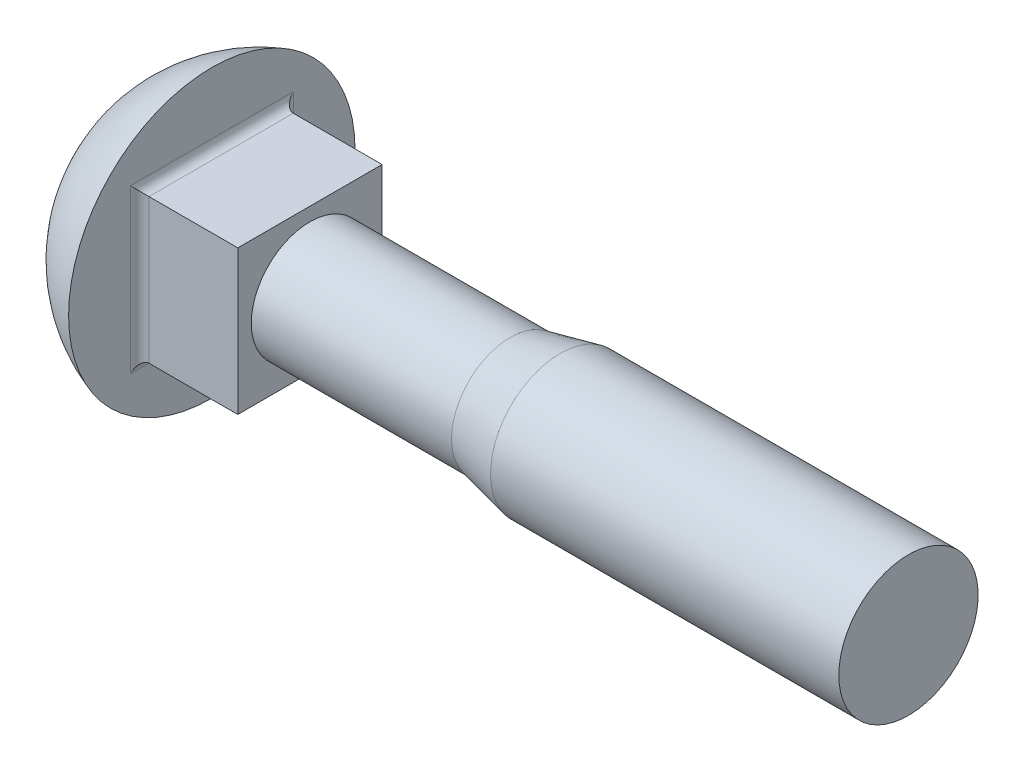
ISO-10303-21;
HEADER;
FILE_DESCRIPTION(('STEP AP214'),'2;1');
FILE_NAME('part.step','',(''),(''),'','','');
FILE_SCHEMA(('AUTOMOTIVE_DESIGN { 1 0 10303 214 1 1 1 1 }'));
ENDSEC;
DATA;
#1=APPLICATION_CONTEXT('core data for automotive mechanical design processes');
#2=APPLICATION_PROTOCOL_DEFINITION('international standard','automotive_design',2000,#1);
#3=PRODUCT_CONTEXT('',#1,'mechanical');
#4=PRODUCT('Part','Part','',(#3));
#5=PRODUCT_RELATED_PRODUCT_CATEGORY('part','',(#4));
#6=PRODUCT_DEFINITION_FORMATION('','',#4);
#7=PRODUCT_DEFINITION_CONTEXT('part definition',#1,'design');
#8=PRODUCT_DEFINITION('design','',#6,#7);
#9=PRODUCT_DEFINITION_SHAPE('','',#8);
#10=(LENGTH_UNIT() NAMED_UNIT(*) SI_UNIT(.MILLI.,.METRE.));
#11=(NAMED_UNIT(*) PLANE_ANGLE_UNIT() SI_UNIT($,.RADIAN.));
#12=(NAMED_UNIT(*) SI_UNIT($,.STERADIAN.) SOLID_ANGLE_UNIT());
#13=UNCERTAINTY_MEASURE_WITH_UNIT(LENGTH_MEASURE(1.E-05),#10,'distance_accuracy_value','');
#14=(GEOMETRIC_REPRESENTATION_CONTEXT(3) GLOBAL_UNCERTAINTY_ASSIGNED_CONTEXT((#13)) GLOBAL_UNIT_ASSIGNED_CONTEXT((#10,
#11,#12)) REPRESENTATION_CONTEXT('',''));
#15=CARTESIAN_POINT('',(0.,0.,0.));
#16=DIRECTION('',(0.,0.,1.));
#17=DIRECTION('',(1.,0.,0.));
#18=AXIS2_PLACEMENT_3D('',#15,#16,#17);
#19=CARTESIAN_POINT('',(17.35,-6.21499999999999,6.215));
#20=DIRECTION('',(-1.,0.,0.));
#21=DIRECTION('',(0.,0.,1.));
#22=AXIS2_PLACEMENT_3D('',#19,#20,#21);
#23=PLANE('',#22);
#24=DIRECTION('',(0.,0.,-1.));
#25=VECTOR('',#24,1.);
#26=CARTESIAN_POINT('',(17.35,-6.215,6.215));
#27=LINE('',#26,#25);
#28=CARTESIAN_POINT('',(17.35,-6.215,6.215));
#29=VERTEX_POINT('',#28);
#30=CARTESIAN_POINT('',(17.35,-6.215,-6.215));
#31=VERTEX_POINT('',#30);
#32=EDGE_CURVE('E109',#29,#31,#27,.T.);
#33=ORIENTED_EDGE('',*,*,#32,.T.);
#34=DIRECTION('',(0.,1.,0.));
#35=VECTOR('',#34,1.);
#36=CARTESIAN_POINT('',(17.35,-6.215,-6.215));
#37=LINE('',#36,#35);
#38=CARTESIAN_POINT('',(17.35,6.215,-6.215));
#39=VERTEX_POINT('',#38);
#40=EDGE_CURVE('E98',#31,#39,#37,.T.);
#41=ORIENTED_EDGE('',*,*,#40,.T.);
#42=DIRECTION('',(0.,0.,1.));
#43=VECTOR('',#42,1.);
#44=CARTESIAN_POINT('',(17.35,6.215,-6.215));
#45=LINE('',#44,#43);
#46=CARTESIAN_POINT('',(17.35,6.215,6.215));
#47=VERTEX_POINT('',#46);
#48=EDGE_CURVE('E108',#39,#47,#45,.T.);
#49=ORIENTED_EDGE('',*,*,#48,.T.);
#50=DIRECTION('',(0.,-1.,0.));
#51=VECTOR('',#50,1.);
#52=CARTESIAN_POINT('',(17.35,6.215,6.215));
#53=LINE('',#52,#51);
#54=EDGE_CURVE('E114',#47,#29,#53,.T.);
#55=ORIENTED_EDGE('',*,*,#54,.T.);
#56=EDGE_LOOP('',(#33,#41,#49,#55));
#57=FACE_BOUND('',#56,.T.);
#58=CARTESIAN_POINT('',(17.35,0.,0.));
#59=DIRECTION('',(-1.,0.,0.));
#60=DIRECTION('',(0.,0.,1.));
#61=AXIS2_PLACEMENT_3D('',#58,#59,#60);
#62=CIRCLE('',#61,5.053);
#63=CARTESIAN_POINT('',(17.35,0.,5.053));
#64=VERTEX_POINT('',#63);
#65=EDGE_CURVE('E154',#64,#64,#62,.T.);
#66=ORIENTED_EDGE('',*,*,#65,.T.);
#67=EDGE_LOOP('',(#66));
#68=FACE_BOUND('',#67,.T.);
#69=ADVANCED_FACE('F43',(#57,#68),#23,.F.);
#70=CARTESIAN_POINT('',(17.35,-6.215,6.215));
#71=DIRECTION('',(0.,1.,0.));
#72=DIRECTION('',(0.,0.,1.));
#73=AXIS2_PLACEMENT_3D('',#70,#71,#72);
#74=PLANE('',#73);
#75=DIRECTION('',(-1.,0.,0.));
#76=VECTOR('',#75,1.);
#77=CARTESIAN_POINT('',(17.35,-6.215,6.215));
#78=LINE('',#77,#76);
#79=CARTESIAN_POINT('',(9.7,-6.215,6.215));
#80=VERTEX_POINT('',#79);
#81=EDGE_CURVE('E169',#29,#80,#78,.T.);
#82=ORIENTED_EDGE('',*,*,#81,.T.);
#83=DIRECTION('',(0.,0.,-1.));
#84=VECTOR('',#83,1.);
#85=CARTESIAN_POINT('',(9.7,-6.215,-6.215));
#86=LINE('',#85,#84);
#87=CARTESIAN_POINT('',(9.7,-6.215,-6.215));
#88=VERTEX_POINT('',#87);
#89=EDGE_CURVE('E120',#80,#88,#86,.T.);
#90=ORIENTED_EDGE('',*,*,#89,.T.);
#91=DIRECTION('',(-1.,0.,0.));
#92=VECTOR('',#91,1.);
#93=CARTESIAN_POINT('',(17.35,-6.215,-6.215));
#94=LINE('',#93,#92);
#95=EDGE_CURVE('E103',#31,#88,#94,.T.);
#96=ORIENTED_EDGE('',*,*,#95,.F.);
#97=ORIENTED_EDGE('',*,*,#32,.F.);
#98=EDGE_LOOP('',(#82,#90,#96,#97));
#99=FACE_BOUND('',#98,.T.);
#100=ADVANCED_FACE('F118',(#99),#74,.F.);
#101=CARTESIAN_POINT('',(17.35,-6.215,-6.215));
#102=DIRECTION('',(0.,0.,1.));
#103=DIRECTION('',(1.,0.,0.));
#104=AXIS2_PLACEMENT_3D('',#101,#102,#103);
#105=PLANE('',#104);
#106=ORIENTED_EDGE('',*,*,#95,.T.);
#107=DIRECTION('',(0.,1.,0.));
#108=VECTOR('',#107,1.);
#109=CARTESIAN_POINT('',(9.7,6.215,-6.215));
#110=LINE('',#109,#108);
#111=CARTESIAN_POINT('',(9.7,6.215,-6.215));
#112=VERTEX_POINT('',#111);
#113=EDGE_CURVE('E132',#88,#112,#110,.T.);
#114=ORIENTED_EDGE('',*,*,#113,.T.);
#115=DIRECTION('',(-1.,0.,0.));
#116=VECTOR('',#115,1.);
#117=CARTESIAN_POINT('',(17.35,6.215,-6.215));
#118=LINE('',#117,#116);
#119=EDGE_CURVE('E105',#39,#112,#118,.T.);
#120=ORIENTED_EDGE('',*,*,#119,.F.);
#121=ORIENTED_EDGE('',*,*,#40,.F.);
#122=EDGE_LOOP('',(#106,#114,#120,#121));
#123=FACE_BOUND('',#122,.T.);
#124=ADVANCED_FACE('F100',(#123),#105,.F.);
#125=CARTESIAN_POINT('',(17.35,6.215,-6.215));
#126=DIRECTION('',(0.,-1.,0.));
#127=DIRECTION('',(0.,0.,-1.));
#128=AXIS2_PLACEMENT_3D('',#125,#126,#127);
#129=PLANE('',#128);
#130=ORIENTED_EDGE('',*,*,#119,.T.);
#131=DIRECTION('',(0.,0.,1.));
#132=VECTOR('',#131,1.);
#133=CARTESIAN_POINT('',(9.7,6.215,6.215));
#134=LINE('',#133,#132);
#135=CARTESIAN_POINT('',(9.7,6.215,6.215));
#136=VERTEX_POINT('',#135);
#137=EDGE_CURVE('E11',#112,#136,#134,.T.);
#138=ORIENTED_EDGE('',*,*,#137,.T.);
#139=DIRECTION('',(-1.,0.,0.));
#140=VECTOR('',#139,1.);
#141=CARTESIAN_POINT('',(17.35,6.215,6.215));
#142=LINE('',#141,#140);
#143=EDGE_CURVE('E126',#47,#136,#142,.T.);
#144=ORIENTED_EDGE('',*,*,#143,.F.);
#145=ORIENTED_EDGE('',*,*,#48,.F.);
#146=EDGE_LOOP('',(#130,#138,#144,#145));
#147=FACE_BOUND('',#146,.T.);
#148=ADVANCED_FACE('F179',(#147),#129,.F.);
#149=CARTESIAN_POINT('',(17.35,6.215,6.215));
#150=DIRECTION('',(0.,0.,-1.));
#151=DIRECTION('',(-1.,0.,0.));
#152=AXIS2_PLACEMENT_3D('',#149,#150,#151);
#153=PLANE('',#152);
#154=ORIENTED_EDGE('',*,*,#143,.T.);
#155=DIRECTION('',(0.,-1.,0.));
#156=VECTOR('',#155,1.);
#157=CARTESIAN_POINT('',(9.7,-6.215,6.215));
#158=LINE('',#157,#156);
#159=EDGE_CURVE('E52',#136,#80,#158,.T.);
#160=ORIENTED_EDGE('',*,*,#159,.T.);
#161=ORIENTED_EDGE('',*,*,#81,.F.);
#162=ORIENTED_EDGE('',*,*,#54,.F.);
#163=EDGE_LOOP('',(#154,#160,#161,#162));
#164=FACE_BOUND('',#163,.T.);
#165=ADVANCED_FACE('F170',(#164),#153,.F.);
#166=CARTESIAN_POINT('',(13.,0.,0.));
#167=DIRECTION('',(-1.,0.,0.));
#168=DIRECTION('',(0.,1.,0.));
#169=AXIS2_PLACEMENT_3D('',#166,#167,#168);
#170=SPHERICAL_SURFACE('',#169,13.);
#171=CARTESIAN_POINT('',(8.9,0.,0.));
#172=DIRECTION('',(-1.,0.,0.));
#173=DIRECTION('',(0.,0.,1.));
#174=AXIS2_PLACEMENT_3D('',#171,#172,#173);
#175=CIRCLE('',#174,12.3365311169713);
#176=CARTESIAN_POINT('',(8.9,0.,12.3365311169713));
#177=VERTEX_POINT('',#176);
#178=EDGE_CURVE('E121',#177,#177,#175,.T.);
#179=ORIENTED_EDGE('',*,*,#178,.T.);
#180=EDGE_LOOP('',(#179));
#181=FACE_BOUND('',#180,.T.);
#182=ADVANCED_FACE('F186',(#181),#170,.T.);
#183=CARTESIAN_POINT('',(8.9,6.,0.));
#184=DIRECTION('',(-1.,0.,0.));
#185=DIRECTION('',(0.,0.,1.));
#186=AXIS2_PLACEMENT_3D('',#183,#184,#185);
#187=PLANE('',#186);
#188=DIRECTION('',(0.,0.,1.));
#189=VECTOR('',#188,1.);
#190=CARTESIAN_POINT('',(8.9,7.015,-6.215));
#191=LINE('',#190,#189);
#192=CARTESIAN_POINT('',(8.9,7.015,7.015));
#193=VERTEX_POINT('',#192);
#194=CARTESIAN_POINT('',(8.9,7.015,-7.015));
#195=VERTEX_POINT('',#194);
#196=EDGE_CURVE('E134',#193,#195,#191,.F.);
#197=ORIENTED_EDGE('',*,*,#196,.T.);
#198=DIRECTION('',(0.,1.,0.));
#199=VECTOR('',#198,1.);
#200=CARTESIAN_POINT('',(8.9,-6.215,-7.015));
#201=LINE('',#200,#199);
#202=CARTESIAN_POINT('',(8.9,-7.015,-7.015));
#203=VERTEX_POINT('',#202);
#204=EDGE_CURVE('E140',#195,#203,#201,.F.);
#205=ORIENTED_EDGE('',*,*,#204,.T.);
#206=DIRECTION('',(0.,0.,-1.));
#207=VECTOR('',#206,1.);
#208=CARTESIAN_POINT('',(8.9,-7.015,6.215));
#209=LINE('',#208,#207);
#210=CARTESIAN_POINT('',(8.9,-7.015,7.015));
#211=VERTEX_POINT('',#210);
#212=EDGE_CURVE('E138',#203,#211,#209,.F.);
#213=ORIENTED_EDGE('',*,*,#212,.T.);
#214=DIRECTION('',(0.,-1.,0.));
#215=VECTOR('',#214,1.);
#216=CARTESIAN_POINT('',(8.9,6.215,7.015));
#217=LINE('',#216,#215);
#218=EDGE_CURVE('E136',#211,#193,#217,.F.);
#219=ORIENTED_EDGE('',*,*,#218,.T.);
#220=EDGE_LOOP('',(#197,#205,#213,#219));
#221=FACE_BOUND('',#220,.T.);
#222=ORIENTED_EDGE('',*,*,#178,.F.);
#223=EDGE_LOOP('',(#222));
#224=FACE_BOUND('',#223,.T.);
#225=ADVANCED_FACE('F201',(#221,#224),#187,.F.);
#226=CARTESIAN_POINT('',(34.6,0.,0.));
#227=DIRECTION('',(1.,0.,0.));
#228=DIRECTION('',(0.,0.,-1.));
#229=AXIS2_PLACEMENT_3D('',#226,#227,#228);
#230=CONICAL_SURFACE('',#229,5.053,0.216772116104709);
#231=CARTESIAN_POINT('',(38.9,0.,0.));
#232=DIRECTION('',(-1.,0.,0.));
#233=DIRECTION('',(0.,0.,1.));
#234=AXIS2_PLACEMENT_3D('',#231,#232,#233);
#235=CIRCLE('',#234,6.);
#236=CARTESIAN_POINT('',(38.9,0.,6.));
#237=VERTEX_POINT('',#236);
#238=EDGE_CURVE('E116',#237,#237,#235,.T.);
#239=ORIENTED_EDGE('',*,*,#238,.T.);
#240=EDGE_LOOP('',(#239));
#241=FACE_BOUND('',#240,.T.);
#242=CARTESIAN_POINT('',(34.6,0.,0.));
#243=DIRECTION('',(-1.,0.,0.));
#244=DIRECTION('',(0.,0.,1.));
#245=AXIS2_PLACEMENT_3D('',#242,#243,#244);
#246=CIRCLE('',#245,5.053);
#247=CARTESIAN_POINT('',(34.6,0.,5.053));
#248=VERTEX_POINT('',#247);
#249=EDGE_CURVE('E159',#248,#248,#246,.T.);
#250=ORIENTED_EDGE('',*,*,#249,.F.);
#251=EDGE_LOOP('',(#250));
#252=FACE_BOUND('',#251,.T.);
#253=ADVANCED_FACE('F198',(#241,#252),#230,.T.);
#254=CARTESIAN_POINT('',(0.,0.,0.));
#255=DIRECTION('',(-1.,0.,0.));
#256=DIRECTION('',(0.,0.,1.));
#257=AXIS2_PLACEMENT_3D('',#254,#255,#256);
#258=CYLINDRICAL_SURFACE('',#257,5.053);
#259=ORIENTED_EDGE('',*,*,#249,.T.);
#260=EDGE_LOOP('',(#259));
#261=FACE_BOUND('',#260,.T.);
#262=ORIENTED_EDGE('',*,*,#65,.F.);
#263=EDGE_LOOP('',(#262));
#264=FACE_BOUND('',#263,.T.);
#265=ADVANCED_FACE('F200',(#261,#264),#258,.T.);
#266=CARTESIAN_POINT('',(68.9,0.,0.));
#267=DIRECTION('',(-1.,0.,0.));
#268=DIRECTION('',(0.,0.,1.));
#269=AXIS2_PLACEMENT_3D('',#266,#267,#268);
#270=PLANE('',#269);
#271=CARTESIAN_POINT('',(68.9,0.,0.));
#272=DIRECTION('',(-1.,0.,0.));
#273=DIRECTION('',(0.,0.,1.));
#274=AXIS2_PLACEMENT_3D('',#271,#272,#273);
#275=CIRCLE('',#274,6.00000000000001);
#276=CARTESIAN_POINT('',(68.9,0.,6.00000000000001));
#277=VERTEX_POINT('',#276);
#278=EDGE_CURVE('E124',#277,#277,#275,.T.);
#279=ORIENTED_EDGE('',*,*,#278,.F.);
#280=EDGE_LOOP('',(#279));
#281=FACE_BOUND('',#280,.T.);
#282=ADVANCED_FACE('F204',(#281),#270,.F.);
#283=CARTESIAN_POINT('',(-31.4843454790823,0.,0.));
#284=DIRECTION('',(-1.,0.,0.));
#285=DIRECTION('',(0.,0.,1.));
#286=AXIS2_PLACEMENT_3D('',#283,#284,#285);
#287=CYLINDRICAL_SURFACE('',#286,6.);
#288=ORIENTED_EDGE('',*,*,#278,.T.);
#289=EDGE_LOOP('',(#288));
#290=FACE_BOUND('',#289,.T.);
#291=ORIENTED_EDGE('',*,*,#238,.F.);
#292=EDGE_LOOP('',(#291));
#293=FACE_BOUND('',#292,.T.);
#294=ADVANCED_FACE('F210',(#290,#293),#287,.T.);
#295=CARTESIAN_POINT('',(9.7,6.215,7.015));
#296=DIRECTION('',(0.,1.,0.));
#297=DIRECTION('',(0.,0.,1.));
#298=AXIS2_PLACEMENT_3D('',#295,#296,#297);
#299=CYLINDRICAL_SURFACE('',#298,0.8);
#300=CARTESIAN_POINT('',(9.7,7.015,7.015));
#301=DIRECTION('',(0.,0.707106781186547,-0.707106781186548));
#302=DIRECTION('',(0.,-0.707106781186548,-0.707106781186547));
#303=AXIS2_PLACEMENT_3D('',#300,#301,#302);
#304=ELLIPSE('',#303,1.13137084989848,0.8);
#305=EDGE_CURVE('E148',#193,#136,#304,.F.);
#306=ORIENTED_EDGE('',*,*,#305,.F.);
#307=ORIENTED_EDGE('',*,*,#218,.F.);
#308=CARTESIAN_POINT('',(9.7,-7.015,7.015));
#309=DIRECTION('',(0.,0.707106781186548,0.707106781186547));
#310=DIRECTION('',(0.,0.707106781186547,-0.707106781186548));
#311=AXIS2_PLACEMENT_3D('',#308,#309,#310);
#312=ELLIPSE('',#311,1.13137084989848,0.8);
#313=EDGE_CURVE('E47',#80,#211,#312,.T.);
#314=ORIENTED_EDGE('',*,*,#313,.F.);
#315=ORIENTED_EDGE('',*,*,#159,.F.);
#316=EDGE_LOOP('',(#306,#307,#314,#315));
#317=FACE_BOUND('',#316,.T.);
#318=ADVANCED_FACE('F45',(#317),#299,.F.);
#319=CARTESIAN_POINT('',(9.7,-7.015,6.215));
#320=DIRECTION('',(0.,0.,1.));
#321=DIRECTION('',(0.,-1.,0.));
#322=AXIS2_PLACEMENT_3D('',#319,#320,#321);
#323=CYLINDRICAL_SURFACE('',#322,0.8);
#324=ORIENTED_EDGE('',*,*,#313,.T.);
#325=ORIENTED_EDGE('',*,*,#212,.F.);
#326=CARTESIAN_POINT('',(9.7,-7.015,-7.015));
#327=DIRECTION('',(0.,-0.707106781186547,0.707106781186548));
#328=DIRECTION('',(0.,0.707106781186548,0.707106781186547));
#329=AXIS2_PLACEMENT_3D('',#326,#327,#328);
#330=ELLIPSE('',#329,1.13137084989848,0.8);
#331=EDGE_CURVE('E147',#88,#203,#330,.T.);
#332=ORIENTED_EDGE('',*,*,#331,.F.);
#333=ORIENTED_EDGE('',*,*,#89,.F.);
#334=EDGE_LOOP('',(#324,#325,#332,#333));
#335=FACE_BOUND('',#334,.T.);
#336=ADVANCED_FACE('F173',(#335),#323,.F.);
#337=CARTESIAN_POINT('',(9.7,7.015,-6.215));
#338=DIRECTION('',(0.,0.,-1.));
#339=DIRECTION('',(0.,1.,0.));
#340=AXIS2_PLACEMENT_3D('',#337,#338,#339);
#341=CYLINDRICAL_SURFACE('',#340,0.8);
#342=ORIENTED_EDGE('',*,*,#305,.T.);
#343=ORIENTED_EDGE('',*,*,#137,.F.);
#344=CARTESIAN_POINT('',(9.7,7.015,-7.015));
#345=DIRECTION('',(0.,-0.707106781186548,-0.707106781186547));
#346=DIRECTION('',(0.,0.707106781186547,-0.707106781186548));
#347=AXIS2_PLACEMENT_3D('',#344,#345,#346);
#348=ELLIPSE('',#347,1.13137084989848,0.8);
#349=EDGE_CURVE('E145',#195,#112,#348,.F.);
#350=ORIENTED_EDGE('',*,*,#349,.F.);
#351=ORIENTED_EDGE('',*,*,#196,.F.);
#352=EDGE_LOOP('',(#342,#343,#350,#351));
#353=FACE_BOUND('',#352,.T.);
#354=ADVANCED_FACE('F226',(#353),#341,.F.);
#355=CARTESIAN_POINT('',(9.7,-6.215,-7.015));
#356=DIRECTION('',(0.,-1.,0.));
#357=DIRECTION('',(0.,0.,-1.));
#358=AXIS2_PLACEMENT_3D('',#355,#356,#357);
#359=CYLINDRICAL_SURFACE('',#358,0.8);
#360=ORIENTED_EDGE('',*,*,#331,.T.);
#361=ORIENTED_EDGE('',*,*,#204,.F.);
#362=ORIENTED_EDGE('',*,*,#349,.T.);
#363=ORIENTED_EDGE('',*,*,#113,.F.);
#364=EDGE_LOOP('',(#360,#361,#362,#363));
#365=FACE_BOUND('',#364,.T.);
#366=ADVANCED_FACE('F177',(#365),#359,.F.);
#367=CLOSED_SHELL('',(#69,#100,#124,#148,#165,#182,#225,#253,#265,#282,#294,#318,#336,#354,#366));
#368=MANIFOLD_SOLID_BREP('B2',#367);
#369=ADVANCED_BREP_SHAPE_REPRESENTATION('',(#18,#368),#14);
#370=SHAPE_DEFINITION_REPRESENTATION(#9,#369);
ENDSEC;
END-ISO-10303-21;
